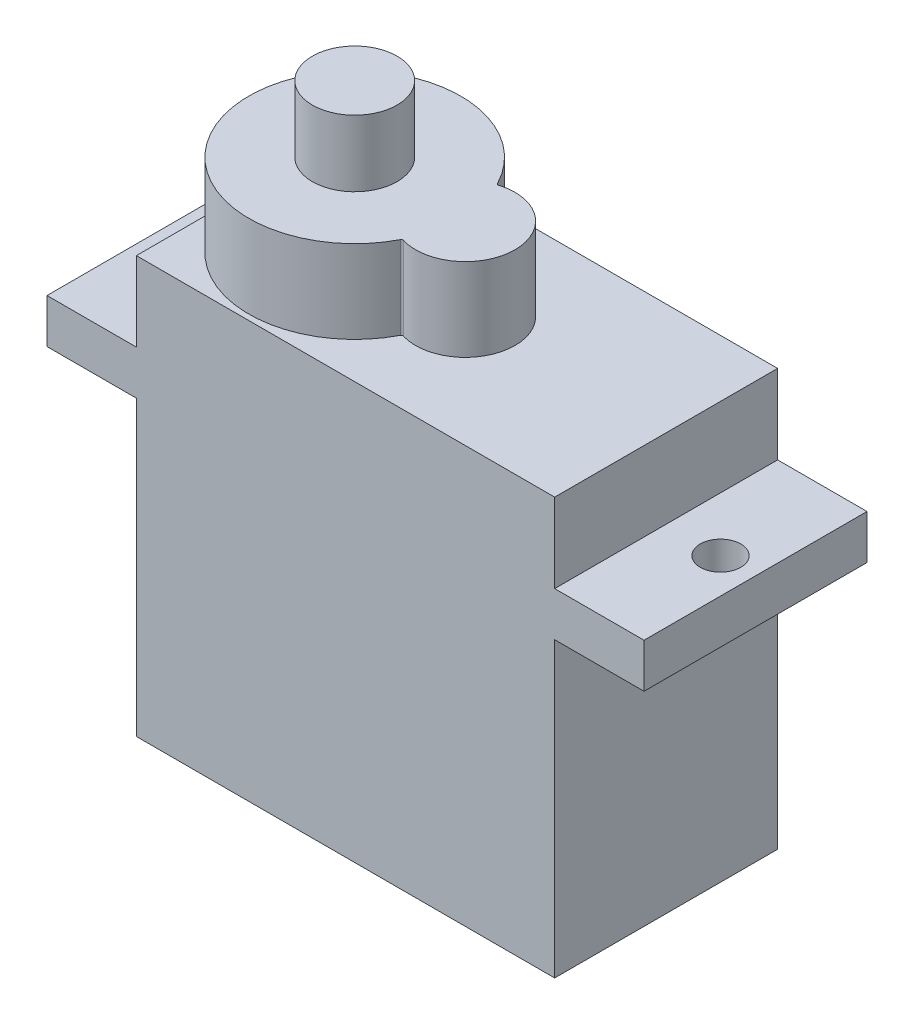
from build123d import *

# Parameters (mm, degrees)
BOSS_EXTRUDE1_DEPTH = 12.1
SKETCH3_R           = 1.1
CUT_EXTRUDE1_DEPTH  = 12.1
BOSS_EXTRUDE2_DEPTH = 4.5
FILLET1_R           = 0.1
SKETCH5_R           = 2.3
BOSS_EXTRUDE3_DEPTH = 3.6


with BuildPart() as part:
    # Sketch1 → Boss-Extrude1 (new body)
    with BuildSketch(Plane.XY):
        Polygon((0, -4.3), (-4.85, -4.3), (-4.85, -6.7), (0, -6.7), (0, -22.6), (22.7, -22.6), (22.7, -6.7), (27.55, -6.7), (27.55, -4.3), (22.7, -4.3), (22.7, 0), (0, 0), align=None)
    extrude(amount=BOSS_EXTRUDE1_DEPTH)

    # Sketch3 → Cut-Extrude1 (cut)
    with BuildSketch(Plane(origin=(0, -4.3, 0), x_dir=(1, 0, 0), z_dir=(0, 1, 0))):
        with Locations(Location((-2.95, -6.05, 0), (0, 0, 180))):
            Circle(SKETCH3_R)
        with Locations(Location((25.65, -6.05, 0), (0, 0, 180))):
            Circle(SKETCH3_R)
    extrude(amount=-CUT_EXTRUDE1_DEPTH, mode=Mode.SUBTRACT)

    # Sketch4 → Boss-Extrude2 (add)
    with BuildSketch(Plane(origin=(0, 0, 0), x_dir=(1, 0, 0), z_dir=(0, 1, 0))):
        with BuildLine():
            ThreePointArc((10.947708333, -3.488047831), (0.05, -6.05), (10.947708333, -8.611952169))
            ThreePointArc((10.947708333, -8.611952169), (14.5, -6.05), (10.947708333, -3.488047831))
        make_face()
    extrude(amount=BOSS_EXTRUDE2_DEPTH)

    # Fillet1
    fillet1_edges = [part.edges().sort_by_distance(p)[0] for p in [
        (10.947708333, 2.25, 8.611952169),
        (10.947708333, 2.25, 3.488047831),
    ]]
    fillet(fillet1_edges, radius=FILLET1_R)

    # Sketch5 → Boss-Extrude3 (add)
    with BuildSketch(Plane(origin=(0, 4.5, 0), x_dir=(1, 0, 0), z_dir=(0, 1, 0))):
        with Locations(Location((5.8, -6.05, 0), (0, 0, 270))):
            Circle(SKETCH5_R)
    extrude(amount=BOSS_EXTRUDE3_DEPTH)


solid = part.part
